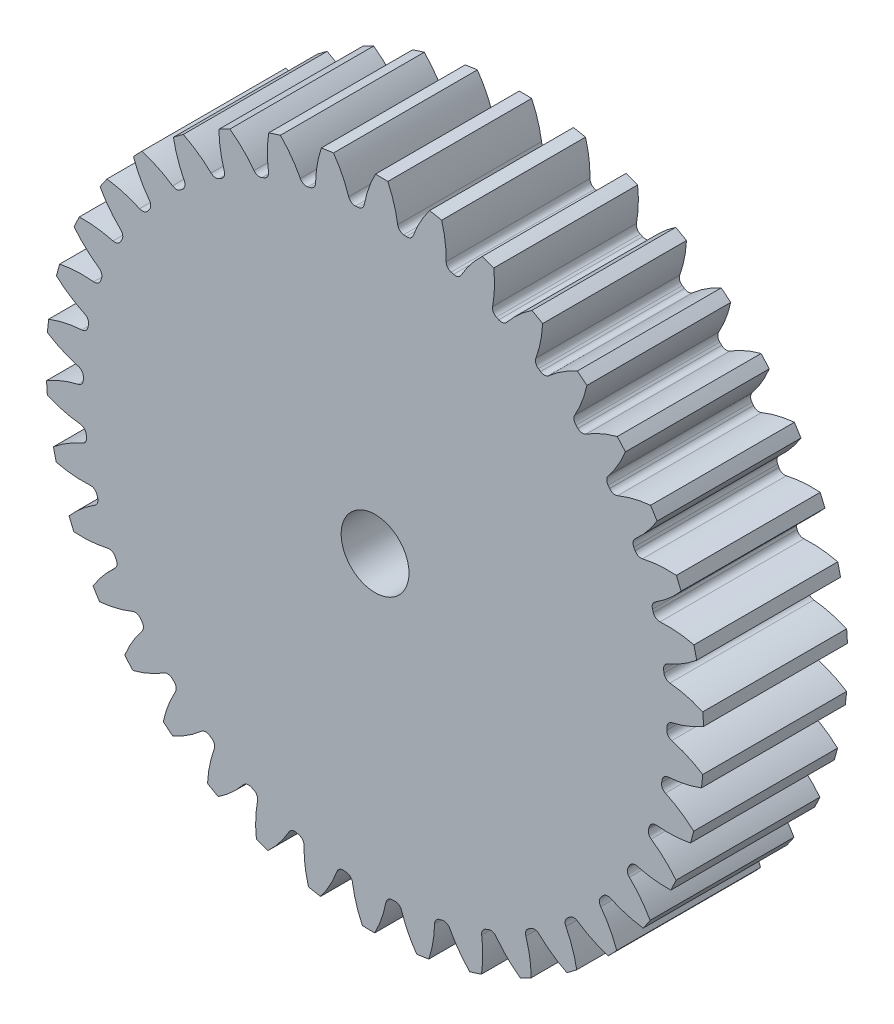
from build123d import *

# Parameters (mm, degrees)
SKETCH3_R         = 203.2
GEARBODY_DEPTH    = 88.9
TOOTHCUT_DEPTH    = 301.805069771
CIRPATTERN1_COUNT = 38
BOREDIA_R         = 20.955
BORE_DEPTH        = 12700


with BuildPart() as part:
    # Sketch3 → gearBody (new body)
    with BuildSketch(Plane.XY):
        Circle(SKETCH3_R)
    extrude(amount=GEARBODY_DEPTH)

    # Sketch2 → toothCut (cut, through all)
    with BuildSketch(Plane.XY):
        with BuildLine():
            ThreePointArc((180.286544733, -4.39060225), (180.304246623, -3.590856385), (180.318400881, -2.791039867))
            ThreePointArc((180.318400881, -2.791039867), (181.233840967, -0.259643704), (183.513448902, 1.171923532))
            ThreePointArc((183.513448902, 1.171923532), (193.656873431, 4.367212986), (203.2, 9.060577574))
            ThreePointArc((203.2, 9.060577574), (203.361577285, -4.05005557), (202.678124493, -17.143859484))
            ThreePointArc((202.678124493, -17.143859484), (193.32943274, -12.074254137), (183.321272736, -8.477635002))
            ThreePointArc((183.321272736, -8.477635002), (181.100470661, -6.956439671), (180.286544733, -4.39060225))
        make_face()
    toothcut = extrude(amount=TOOTHCUT_DEPTH, mode=Mode.SUBTRACT)

    # CirPattern1: toothCut ×38 about axis
    cirpattern1_axis = Axis((0, 0, 0), (0, 0, 1))
    for i in range(1, CIRPATTERN1_COUNT):
        add(toothcut.rotate(cirpattern1_axis, i * 360 / CIRPATTERN1_COUNT), mode=Mode.SUBTRACT)

    # boreDia → bore (cut, symmetric)
    with BuildSketch(Plane.XY):
        Circle(BOREDIA_R)
    extrude(amount=BORE_DEPTH, both=True, mode=Mode.SUBTRACT)


solid = part.part
